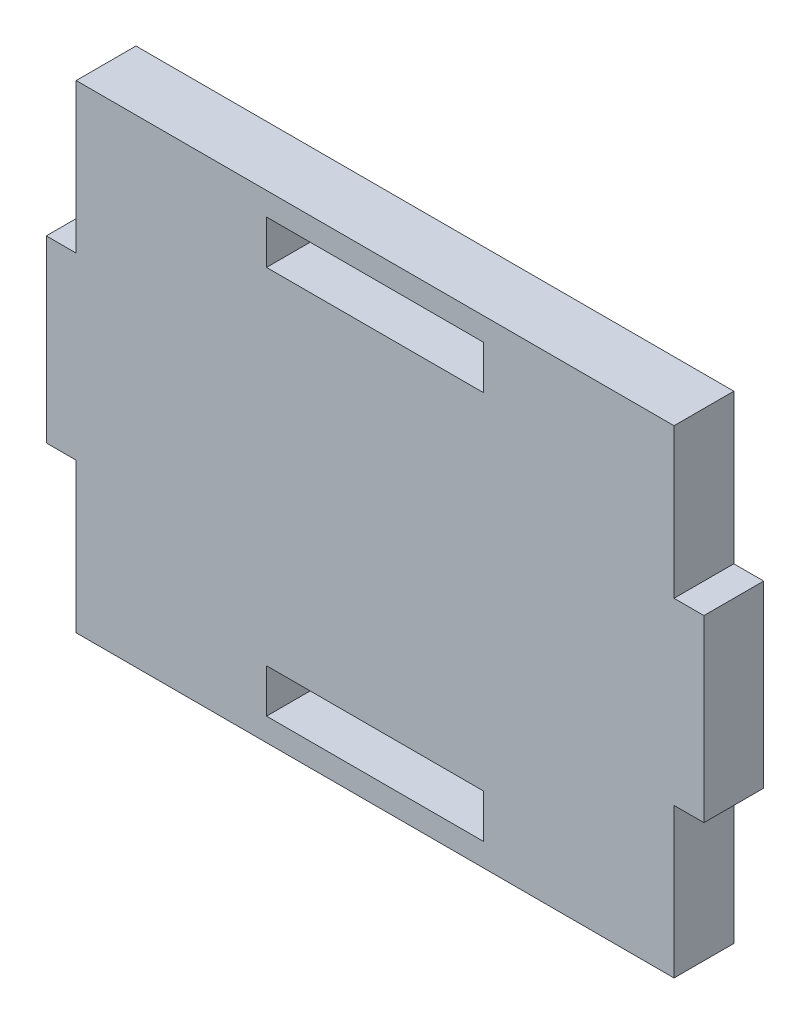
ISO-10303-21;
HEADER;
FILE_DESCRIPTION(('STEP AP214'),'2;1');
FILE_NAME('part.step','',(''),(''),'','','');
FILE_SCHEMA(('AUTOMOTIVE_DESIGN { 1 0 10303 214 1 1 1 1 }'));
ENDSEC;
DATA;
#1=APPLICATION_CONTEXT('core data for automotive mechanical design processes');
#2=APPLICATION_PROTOCOL_DEFINITION('international standard','automotive_design',2000,#1);
#3=PRODUCT_CONTEXT('',#1,'mechanical');
#4=PRODUCT('Part','Part','',(#3));
#5=PRODUCT_RELATED_PRODUCT_CATEGORY('part','',(#4));
#6=PRODUCT_DEFINITION_FORMATION('','',#4);
#7=PRODUCT_DEFINITION_CONTEXT('part definition',#1,'design');
#8=PRODUCT_DEFINITION('design','',#6,#7);
#9=PRODUCT_DEFINITION_SHAPE('','',#8);
#10=(LENGTH_UNIT() NAMED_UNIT(*) SI_UNIT(.MILLI.,.METRE.));
#11=(NAMED_UNIT(*) PLANE_ANGLE_UNIT() SI_UNIT($,.RADIAN.));
#12=(NAMED_UNIT(*) SI_UNIT($,.STERADIAN.) SOLID_ANGLE_UNIT());
#13=UNCERTAINTY_MEASURE_WITH_UNIT(LENGTH_MEASURE(1.E-05),#10,'distance_accuracy_value','');
#14=(GEOMETRIC_REPRESENTATION_CONTEXT(3) GLOBAL_UNCERTAINTY_ASSIGNED_CONTEXT((#13)) GLOBAL_UNIT_ASSIGNED_CONTEXT((#10,
#11,#12)) REPRESENTATION_CONTEXT('',''));
#15=CARTESIAN_POINT('',(0.,0.,0.));
#16=DIRECTION('',(0.,0.,1.));
#17=DIRECTION('',(1.,0.,0.));
#18=AXIS2_PLACEMENT_3D('',#15,#16,#17);
#19=CARTESIAN_POINT('',(0.,0.,10.));
#20=DIRECTION('',(0.,0.,-1.));
#21=DIRECTION('',(-1.,0.,0.));
#22=AXIS2_PLACEMENT_3D('',#19,#20,#21);
#23=PLANE('',#22);
#24=DIRECTION('',(0.,1.,0.));
#25=VECTOR('',#24,1.);
#26=CARTESIAN_POINT('',(18.1593360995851,28.8485477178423,10.));
#27=LINE('',#26,#25);
#28=CARTESIAN_POINT('',(18.1593360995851,28.8485477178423,10.));
#29=VERTEX_POINT('',#28);
#30=CARTESIAN_POINT('',(18.1593360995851,36.1514522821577,10.));
#31=VERTEX_POINT('',#30);
#32=EDGE_CURVE('E206',#29,#31,#27,.T.);
#33=ORIENTED_EDGE('',*,*,#32,.F.);
#34=DIRECTION('',(1.,0.,0.));
#35=VECTOR('',#34,1.);
#36=CARTESIAN_POINT('',(-18.1593360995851,28.8485477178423,10.));
#37=LINE('',#36,#35);
#38=CARTESIAN_POINT('',(-18.1593360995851,28.8485477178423,10.));
#39=VERTEX_POINT('',#38);
#40=EDGE_CURVE('E214',#39,#29,#37,.T.);
#41=ORIENTED_EDGE('',*,*,#40,.F.);
#42=DIRECTION('',(0.,-1.,0.));
#43=VECTOR('',#42,1.);
#44=CARTESIAN_POINT('',(-18.1593360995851,28.8485477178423,10.));
#45=LINE('',#44,#43);
#46=CARTESIAN_POINT('',(-18.1593360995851,36.1514522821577,10.));
#47=VERTEX_POINT('',#46);
#48=EDGE_CURVE('E211',#47,#39,#45,.T.);
#49=ORIENTED_EDGE('',*,*,#48,.F.);
#50=DIRECTION('',(-1.,0.,0.));
#51=VECTOR('',#50,1.);
#52=CARTESIAN_POINT('',(-18.1593360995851,36.1514522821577,10.));
#53=LINE('',#52,#51);
#54=EDGE_CURVE('E208',#31,#47,#53,.T.);
#55=ORIENTED_EDGE('',*,*,#54,.F.);
#56=EDGE_LOOP('',(#33,#41,#49,#55));
#57=FACE_BOUND('',#56,.T.);
#58=DIRECTION('',(0.,1.,0.));
#59=VECTOR('',#58,1.);
#60=CARTESIAN_POINT('',(50.,15.,10.));
#61=LINE('',#60,#59);
#62=CARTESIAN_POINT('',(50.,15.,10.));
#63=VERTEX_POINT('',#62);
#64=CARTESIAN_POINT('',(50.,40.,10.));
#65=VERTEX_POINT('',#64);
#66=EDGE_CURVE('E237',#63,#65,#61,.T.);
#67=ORIENTED_EDGE('',*,*,#66,.T.);
#68=DIRECTION('',(-1.,0.,0.));
#69=VECTOR('',#68,1.);
#70=CARTESIAN_POINT('',(-50.,40.,10.));
#71=LINE('',#70,#69);
#72=CARTESIAN_POINT('',(-50.,40.,10.));
#73=VERTEX_POINT('',#72);
#74=EDGE_CURVE('E240',#65,#73,#71,.T.);
#75=ORIENTED_EDGE('',*,*,#74,.T.);
#76=DIRECTION('',(0.,-1.,0.));
#77=VECTOR('',#76,1.);
#78=CARTESIAN_POINT('',(-50.,15.,10.));
#79=LINE('',#78,#77);
#80=CARTESIAN_POINT('',(-50.,15.,10.));
#81=VERTEX_POINT('',#80);
#82=EDGE_CURVE('E243',#73,#81,#79,.T.);
#83=ORIENTED_EDGE('',*,*,#82,.T.);
#84=DIRECTION('',(-1.,0.,0.));
#85=VECTOR('',#84,1.);
#86=CARTESIAN_POINT('',(-55.,15.,10.));
#87=LINE('',#86,#85);
#88=CARTESIAN_POINT('',(-55.,15.,10.));
#89=VERTEX_POINT('',#88);
#90=EDGE_CURVE('E245',#81,#89,#87,.T.);
#91=ORIENTED_EDGE('',*,*,#90,.T.);
#92=DIRECTION('',(0.,-1.,0.));
#93=VECTOR('',#92,1.);
#94=CARTESIAN_POINT('',(-55.,-15.,10.));
#95=LINE('',#94,#93);
#96=CARTESIAN_POINT('',(-55.,-15.,10.));
#97=VERTEX_POINT('',#96);
#98=EDGE_CURVE('E247',#89,#97,#95,.T.);
#99=ORIENTED_EDGE('',*,*,#98,.T.);
#100=DIRECTION('',(1.,0.,0.));
#101=VECTOR('',#100,1.);
#102=CARTESIAN_POINT('',(-55.,-15.,10.));
#103=LINE('',#102,#101);
#104=CARTESIAN_POINT('',(-50.,-15.,10.));
#105=VERTEX_POINT('',#104);
#106=EDGE_CURVE('E249',#97,#105,#103,.T.);
#107=ORIENTED_EDGE('',*,*,#106,.T.);
#108=DIRECTION('',(0.,-1.,0.));
#109=VECTOR('',#108,1.);
#110=CARTESIAN_POINT('',(-50.,-40.,10.));
#111=LINE('',#110,#109);
#112=CARTESIAN_POINT('',(-50.,-40.,10.));
#113=VERTEX_POINT('',#112);
#114=EDGE_CURVE('E251',#105,#113,#111,.T.);
#115=ORIENTED_EDGE('',*,*,#114,.T.);
#116=DIRECTION('',(1.,0.,0.));
#117=VECTOR('',#116,1.);
#118=CARTESIAN_POINT('',(-50.,-40.,10.));
#119=LINE('',#118,#117);
#120=CARTESIAN_POINT('',(50.,-40.,10.));
#121=VERTEX_POINT('',#120);
#122=EDGE_CURVE('E253',#113,#121,#119,.T.);
#123=ORIENTED_EDGE('',*,*,#122,.T.);
#124=DIRECTION('',(0.,1.,0.));
#125=VECTOR('',#124,1.);
#126=CARTESIAN_POINT('',(50.,-40.,10.));
#127=LINE('',#126,#125);
#128=CARTESIAN_POINT('',(50.,-15.,10.));
#129=VERTEX_POINT('',#128);
#130=EDGE_CURVE('E255',#121,#129,#127,.T.);
#131=ORIENTED_EDGE('',*,*,#130,.T.);
#132=DIRECTION('',(1.,0.,0.));
#133=VECTOR('',#132,1.);
#134=CARTESIAN_POINT('',(55.,-15.,10.));
#135=LINE('',#134,#133);
#136=CARTESIAN_POINT('',(55.,-15.,10.));
#137=VERTEX_POINT('',#136);
#138=EDGE_CURVE('E257',#129,#137,#135,.T.);
#139=ORIENTED_EDGE('',*,*,#138,.T.);
#140=DIRECTION('',(0.,1.,0.));
#141=VECTOR('',#140,1.);
#142=CARTESIAN_POINT('',(55.,-15.,10.));
#143=LINE('',#142,#141);
#144=CARTESIAN_POINT('',(55.,15.,10.));
#145=VERTEX_POINT('',#144);
#146=EDGE_CURVE('E259',#137,#145,#143,.T.);
#147=ORIENTED_EDGE('',*,*,#146,.T.);
#148=DIRECTION('',(-1.,0.,0.));
#149=VECTOR('',#148,1.);
#150=CARTESIAN_POINT('',(55.,15.,10.));
#151=LINE('',#150,#149);
#152=EDGE_CURVE('E261',#145,#63,#151,.T.);
#153=ORIENTED_EDGE('',*,*,#152,.T.);
#154=EDGE_LOOP('',(#67,#75,#83,#91,#99,#107,#115,#123,#131,#139,#147,#153));
#155=FACE_BOUND('',#154,.T.);
#156=DIRECTION('',(-1.,0.,0.));
#157=VECTOR('',#156,1.);
#158=CARTESIAN_POINT('',(-18.1593360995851,-28.8485477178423,10.));
#159=LINE('',#158,#157);
#160=CARTESIAN_POINT('',(18.1593360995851,-28.8485477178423,10.));
#161=VERTEX_POINT('',#160);
#162=CARTESIAN_POINT('',(-18.1593360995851,-28.8485477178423,10.));
#163=VERTEX_POINT('',#162);
#164=EDGE_CURVE('E170',#161,#163,#159,.T.);
#165=ORIENTED_EDGE('',*,*,#164,.F.);
#166=DIRECTION('',(0.,1.,0.));
#167=VECTOR('',#166,1.);
#168=CARTESIAN_POINT('',(18.1593360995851,-28.8485477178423,10.));
#169=LINE('',#168,#167);
#170=CARTESIAN_POINT('',(18.1593360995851,-36.1514522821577,10.));
#171=VERTEX_POINT('',#170);
#172=EDGE_CURVE('E192',#171,#161,#169,.T.);
#173=ORIENTED_EDGE('',*,*,#172,.F.);
#174=DIRECTION('',(1.,0.,0.));
#175=VECTOR('',#174,1.);
#176=CARTESIAN_POINT('',(-18.1593360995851,-36.1514522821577,10.));
#177=LINE('',#176,#175);
#178=CARTESIAN_POINT('',(-18.1593360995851,-36.1514522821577,10.));
#179=VERTEX_POINT('',#178);
#180=EDGE_CURVE('E190',#179,#171,#177,.T.);
#181=ORIENTED_EDGE('',*,*,#180,.F.);
#182=DIRECTION('',(0.,-1.,0.));
#183=VECTOR('',#182,1.);
#184=CARTESIAN_POINT('',(-18.1593360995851,-28.8485477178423,10.));
#185=LINE('',#184,#183);
#186=EDGE_CURVE('E178',#163,#179,#185,.T.);
#187=ORIENTED_EDGE('',*,*,#186,.F.);
#188=EDGE_LOOP('',(#165,#173,#181,#187));
#189=FACE_BOUND('',#188,.T.);
#190=ADVANCED_FACE('F33',(#57,#155,#189),#23,.F.);
#191=CARTESIAN_POINT('',(0.,0.,0.));
#192=DIRECTION('',(0.,0.,-1.));
#193=DIRECTION('',(-1.,0.,0.));
#194=AXIS2_PLACEMENT_3D('',#191,#192,#193);
#195=PLANE('',#194);
#196=DIRECTION('',(0.,1.,0.));
#197=VECTOR('',#196,1.);
#198=CARTESIAN_POINT('',(50.,15.,0.));
#199=LINE('',#198,#197);
#200=CARTESIAN_POINT('',(50.,15.,0.));
#201=VERTEX_POINT('',#200);
#202=CARTESIAN_POINT('',(50.,40.,0.));
#203=VERTEX_POINT('',#202);
#204=EDGE_CURVE('E236',#201,#203,#199,.T.);
#205=ORIENTED_EDGE('',*,*,#204,.F.);
#206=DIRECTION('',(-1.,0.,0.));
#207=VECTOR('',#206,1.);
#208=CARTESIAN_POINT('',(55.,15.,0.));
#209=LINE('',#208,#207);
#210=CARTESIAN_POINT('',(55.,15.,0.));
#211=VERTEX_POINT('',#210);
#212=EDGE_CURVE('E241',#211,#201,#209,.T.);
#213=ORIENTED_EDGE('',*,*,#212,.F.);
#214=DIRECTION('',(0.,1.,0.));
#215=VECTOR('',#214,1.);
#216=CARTESIAN_POINT('',(55.,-15.,0.));
#217=LINE('',#216,#215);
#218=CARTESIAN_POINT('',(55.,-15.,0.));
#219=VERTEX_POINT('',#218);
#220=EDGE_CURVE('E284',#219,#211,#217,.T.);
#221=ORIENTED_EDGE('',*,*,#220,.F.);
#222=DIRECTION('',(1.,0.,0.));
#223=VECTOR('',#222,1.);
#224=CARTESIAN_POINT('',(55.,-15.,0.));
#225=LINE('',#224,#223);
#226=CARTESIAN_POINT('',(50.,-15.,0.));
#227=VERTEX_POINT('',#226);
#228=EDGE_CURVE('E282',#227,#219,#225,.T.);
#229=ORIENTED_EDGE('',*,*,#228,.F.);
#230=DIRECTION('',(0.,1.,0.));
#231=VECTOR('',#230,1.);
#232=CARTESIAN_POINT('',(50.,-40.,0.));
#233=LINE('',#232,#231);
#234=CARTESIAN_POINT('',(50.,-40.,0.));
#235=VERTEX_POINT('',#234);
#236=EDGE_CURVE('E280',#235,#227,#233,.T.);
#237=ORIENTED_EDGE('',*,*,#236,.F.);
#238=DIRECTION('',(1.,0.,0.));
#239=VECTOR('',#238,1.);
#240=CARTESIAN_POINT('',(-50.,-40.,0.));
#241=LINE('',#240,#239);
#242=CARTESIAN_POINT('',(-50.,-40.,0.));
#243=VERTEX_POINT('',#242);
#244=EDGE_CURVE('E278',#243,#235,#241,.T.);
#245=ORIENTED_EDGE('',*,*,#244,.F.);
#246=DIRECTION('',(0.,-1.,0.));
#247=VECTOR('',#246,1.);
#248=CARTESIAN_POINT('',(-50.,-40.,0.));
#249=LINE('',#248,#247);
#250=CARTESIAN_POINT('',(-50.,-15.,0.));
#251=VERTEX_POINT('',#250);
#252=EDGE_CURVE('E276',#251,#243,#249,.T.);
#253=ORIENTED_EDGE('',*,*,#252,.F.);
#254=DIRECTION('',(1.,0.,0.));
#255=VECTOR('',#254,1.);
#256=CARTESIAN_POINT('',(-55.,-15.,0.));
#257=LINE('',#256,#255);
#258=CARTESIAN_POINT('',(-55.,-15.,0.));
#259=VERTEX_POINT('',#258);
#260=EDGE_CURVE('E274',#259,#251,#257,.T.);
#261=ORIENTED_EDGE('',*,*,#260,.F.);
#262=DIRECTION('',(0.,-1.,0.));
#263=VECTOR('',#262,1.);
#264=CARTESIAN_POINT('',(-55.,-15.,0.));
#265=LINE('',#264,#263);
#266=CARTESIAN_POINT('',(-55.,15.,0.));
#267=VERTEX_POINT('',#266);
#268=EDGE_CURVE('E272',#267,#259,#265,.T.);
#269=ORIENTED_EDGE('',*,*,#268,.F.);
#270=DIRECTION('',(-1.,0.,0.));
#271=VECTOR('',#270,1.);
#272=CARTESIAN_POINT('',(-55.,15.,0.));
#273=LINE('',#272,#271);
#274=CARTESIAN_POINT('',(-50.,15.,0.));
#275=VERTEX_POINT('',#274);
#276=EDGE_CURVE('E270',#275,#267,#273,.T.);
#277=ORIENTED_EDGE('',*,*,#276,.F.);
#278=DIRECTION('',(0.,-1.,0.));
#279=VECTOR('',#278,1.);
#280=CARTESIAN_POINT('',(-50.,15.,0.));
#281=LINE('',#280,#279);
#282=CARTESIAN_POINT('',(-50.,40.,0.));
#283=VERTEX_POINT('',#282);
#284=EDGE_CURVE('E268',#283,#275,#281,.T.);
#285=ORIENTED_EDGE('',*,*,#284,.F.);
#286=DIRECTION('',(-1.,0.,0.));
#287=VECTOR('',#286,1.);
#288=CARTESIAN_POINT('',(-50.,40.,0.));
#289=LINE('',#288,#287);
#290=EDGE_CURVE('E266',#203,#283,#289,.T.);
#291=ORIENTED_EDGE('',*,*,#290,.F.);
#292=EDGE_LOOP('',(#205,#213,#221,#229,#237,#245,#253,#261,#269,#277,#285,#291));
#293=FACE_BOUND('',#292,.T.);
#294=DIRECTION('',(1.,0.,0.));
#295=VECTOR('',#294,1.);
#296=CARTESIAN_POINT('',(-18.1593360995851,28.8485477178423,0.));
#297=LINE('',#296,#295);
#298=CARTESIAN_POINT('',(-18.1593360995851,28.8485477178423,0.));
#299=VERTEX_POINT('',#298);
#300=CARTESIAN_POINT('',(18.1593360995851,28.8485477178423,0.));
#301=VERTEX_POINT('',#300);
#302=EDGE_CURVE('E209',#299,#301,#297,.T.);
#303=ORIENTED_EDGE('',*,*,#302,.T.);
#304=DIRECTION('',(0.,1.,0.));
#305=VECTOR('',#304,1.);
#306=CARTESIAN_POINT('',(18.1593360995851,28.8485477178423,0.));
#307=LINE('',#306,#305);
#308=CARTESIAN_POINT('',(18.1593360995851,36.1514522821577,0.));
#309=VERTEX_POINT('',#308);
#310=EDGE_CURVE('E186',#301,#309,#307,.T.);
#311=ORIENTED_EDGE('',*,*,#310,.T.);
#312=DIRECTION('',(-1.,0.,0.));
#313=VECTOR('',#312,1.);
#314=CARTESIAN_POINT('',(-18.1593360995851,36.1514522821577,0.));
#315=LINE('',#314,#313);
#316=CARTESIAN_POINT('',(-18.1593360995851,36.1514522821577,0.));
#317=VERTEX_POINT('',#316);
#318=EDGE_CURVE('E219',#309,#317,#315,.T.);
#319=ORIENTED_EDGE('',*,*,#318,.T.);
#320=DIRECTION('',(0.,-1.,0.));
#321=VECTOR('',#320,1.);
#322=CARTESIAN_POINT('',(-18.1593360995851,28.8485477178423,0.));
#323=LINE('',#322,#321);
#324=EDGE_CURVE('E222',#317,#299,#323,.T.);
#325=ORIENTED_EDGE('',*,*,#324,.T.);
#326=EDGE_LOOP('',(#303,#311,#319,#325));
#327=FACE_BOUND('',#326,.T.);
#328=DIRECTION('',(0.,1.,0.));
#329=VECTOR('',#328,1.);
#330=CARTESIAN_POINT('',(18.1593360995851,-28.8485477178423,0.));
#331=LINE('',#330,#329);
#332=CARTESIAN_POINT('',(18.1593360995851,-36.1514522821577,0.));
#333=VERTEX_POINT('',#332);
#334=CARTESIAN_POINT('',(18.1593360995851,-28.8485477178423,0.));
#335=VERTEX_POINT('',#334);
#336=EDGE_CURVE('E179',#333,#335,#331,.T.);
#337=ORIENTED_EDGE('',*,*,#336,.T.);
#338=DIRECTION('',(-1.,0.,0.));
#339=VECTOR('',#338,1.);
#340=CARTESIAN_POINT('',(-18.1593360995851,-28.8485477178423,0.));
#341=LINE('',#340,#339);
#342=CARTESIAN_POINT('',(-18.1593360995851,-28.8485477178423,0.));
#343=VERTEX_POINT('',#342);
#344=EDGE_CURVE('E56',#335,#343,#341,.T.);
#345=ORIENTED_EDGE('',*,*,#344,.T.);
#346=DIRECTION('',(0.,-1.,0.));
#347=VECTOR('',#346,1.);
#348=CARTESIAN_POINT('',(-18.1593360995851,-28.8485477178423,0.));
#349=LINE('',#348,#347);
#350=CARTESIAN_POINT('',(-18.1593360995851,-36.1514522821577,0.));
#351=VERTEX_POINT('',#350);
#352=EDGE_CURVE('E185',#343,#351,#349,.T.);
#353=ORIENTED_EDGE('',*,*,#352,.T.);
#354=DIRECTION('',(1.,0.,0.));
#355=VECTOR('',#354,1.);
#356=CARTESIAN_POINT('',(-18.1593360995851,-36.1514522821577,0.));
#357=LINE('',#356,#355);
#358=EDGE_CURVE('E198',#351,#333,#357,.T.);
#359=ORIENTED_EDGE('',*,*,#358,.T.);
#360=EDGE_LOOP('',(#337,#345,#353,#359));
#361=FACE_BOUND('',#360,.T.);
#362=ADVANCED_FACE('F326',(#293,#327,#361),#195,.T.);
#363=CARTESIAN_POINT('',(50.,15.,10.));
#364=DIRECTION('',(-1.,0.,0.));
#365=DIRECTION('',(0.,-1.,0.));
#366=AXIS2_PLACEMENT_3D('',#363,#364,#365);
#367=PLANE('',#366);
#368=ORIENTED_EDGE('',*,*,#204,.T.);
#369=DIRECTION('',(0.,0.,-1.));
#370=VECTOR('',#369,1.);
#371=CARTESIAN_POINT('',(50.,40.,10.));
#372=LINE('',#371,#370);
#373=EDGE_CURVE('E11',#65,#203,#372,.T.);
#374=ORIENTED_EDGE('',*,*,#373,.F.);
#375=ORIENTED_EDGE('',*,*,#66,.F.);
#376=DIRECTION('',(0.,0.,-1.));
#377=VECTOR('',#376,1.);
#378=CARTESIAN_POINT('',(50.,15.,10.));
#379=LINE('',#378,#377);
#380=EDGE_CURVE('E263',#63,#201,#379,.T.);
#381=ORIENTED_EDGE('',*,*,#380,.T.);
#382=EDGE_LOOP('',(#368,#374,#375,#381));
#383=FACE_BOUND('',#382,.T.);
#384=ADVANCED_FACE('F35',(#383),#367,.F.);
#385=CARTESIAN_POINT('',(-50.,40.,10.));
#386=DIRECTION('',(0.,-1.,0.));
#387=DIRECTION('',(1.,0.,0.));
#388=AXIS2_PLACEMENT_3D('',#385,#386,#387);
#389=PLANE('',#388);
#390=ORIENTED_EDGE('',*,*,#290,.T.);
#391=DIRECTION('',(0.,0.,-1.));
#392=VECTOR('',#391,1.);
#393=CARTESIAN_POINT('',(-50.,40.,10.));
#394=LINE('',#393,#392);
#395=EDGE_CURVE('E41',#73,#283,#394,.T.);
#396=ORIENTED_EDGE('',*,*,#395,.F.);
#397=ORIENTED_EDGE('',*,*,#74,.F.);
#398=ORIENTED_EDGE('',*,*,#373,.T.);
#399=EDGE_LOOP('',(#390,#396,#397,#398));
#400=FACE_BOUND('',#399,.T.);
#401=ADVANCED_FACE('F343',(#400),#389,.F.);
#402=CARTESIAN_POINT('',(-50.,15.,10.));
#403=DIRECTION('',(1.,0.,0.));
#404=DIRECTION('',(0.,0.,-1.));
#405=AXIS2_PLACEMENT_3D('',#402,#403,#404);
#406=PLANE('',#405);
#407=ORIENTED_EDGE('',*,*,#284,.T.);
#408=DIRECTION('',(0.,0.,-1.));
#409=VECTOR('',#408,1.);
#410=CARTESIAN_POINT('',(-50.,15.,10.));
#411=LINE('',#410,#409);
#412=EDGE_CURVE('E313',#81,#275,#411,.T.);
#413=ORIENTED_EDGE('',*,*,#412,.F.);
#414=ORIENTED_EDGE('',*,*,#82,.F.);
#415=ORIENTED_EDGE('',*,*,#395,.T.);
#416=EDGE_LOOP('',(#407,#413,#414,#415));
#417=FACE_BOUND('',#416,.T.);
#418=ADVANCED_FACE('F320',(#417),#406,.F.);
#419=CARTESIAN_POINT('',(-55.,15.,10.));
#420=DIRECTION('',(0.,-1.,0.));
#421=DIRECTION('',(0.,0.,-1.));
#422=AXIS2_PLACEMENT_3D('',#419,#420,#421);
#423=PLANE('',#422);
#424=ORIENTED_EDGE('',*,*,#276,.T.);
#425=DIRECTION('',(0.,0.,-1.));
#426=VECTOR('',#425,1.);
#427=CARTESIAN_POINT('',(-55.,15.,10.));
#428=LINE('',#427,#426);
#429=EDGE_CURVE('E310',#89,#267,#428,.T.);
#430=ORIENTED_EDGE('',*,*,#429,.F.);
#431=ORIENTED_EDGE('',*,*,#90,.F.);
#432=ORIENTED_EDGE('',*,*,#412,.T.);
#433=EDGE_LOOP('',(#424,#430,#431,#432));
#434=FACE_BOUND('',#433,.T.);
#435=ADVANCED_FACE('F332',(#434),#423,.F.);
#436=CARTESIAN_POINT('',(-55.,-15.,10.));
#437=DIRECTION('',(1.,0.,0.));
#438=DIRECTION('',(0.,0.,-1.));
#439=AXIS2_PLACEMENT_3D('',#436,#437,#438);
#440=PLANE('',#439);
#441=ORIENTED_EDGE('',*,*,#268,.T.);
#442=DIRECTION('',(0.,0.,-1.));
#443=VECTOR('',#442,1.);
#444=CARTESIAN_POINT('',(-55.,-15.,10.));
#445=LINE('',#444,#443);
#446=EDGE_CURVE('E307',#97,#259,#445,.T.);
#447=ORIENTED_EDGE('',*,*,#446,.F.);
#448=ORIENTED_EDGE('',*,*,#98,.F.);
#449=ORIENTED_EDGE('',*,*,#429,.T.);
#450=EDGE_LOOP('',(#441,#447,#448,#449));
#451=FACE_BOUND('',#450,.T.);
#452=ADVANCED_FACE('F336',(#451),#440,.F.);
#453=CARTESIAN_POINT('',(-55.,-15.,10.));
#454=DIRECTION('',(0.,1.,0.));
#455=DIRECTION('',(0.,0.,1.));
#456=AXIS2_PLACEMENT_3D('',#453,#454,#455);
#457=PLANE('',#456);
#458=ORIENTED_EDGE('',*,*,#260,.T.);
#459=DIRECTION('',(0.,0.,-1.));
#460=VECTOR('',#459,1.);
#461=CARTESIAN_POINT('',(-50.,-15.,10.));
#462=LINE('',#461,#460);
#463=EDGE_CURVE('E304',#105,#251,#462,.T.);
#464=ORIENTED_EDGE('',*,*,#463,.F.);
#465=ORIENTED_EDGE('',*,*,#106,.F.);
#466=ORIENTED_EDGE('',*,*,#446,.T.);
#467=EDGE_LOOP('',(#458,#464,#465,#466));
#468=FACE_BOUND('',#467,.T.);
#469=ADVANCED_FACE('F376',(#468),#457,.F.);
#470=CARTESIAN_POINT('',(-50.,-40.,10.));
#471=DIRECTION('',(1.,0.,0.));
#472=DIRECTION('',(0.,1.,0.));
#473=AXIS2_PLACEMENT_3D('',#470,#471,#472);
#474=PLANE('',#473);
#475=ORIENTED_EDGE('',*,*,#252,.T.);
#476=DIRECTION('',(0.,0.,-1.));
#477=VECTOR('',#476,1.);
#478=CARTESIAN_POINT('',(-50.,-40.,10.));
#479=LINE('',#478,#477);
#480=EDGE_CURVE('E301',#113,#243,#479,.T.);
#481=ORIENTED_EDGE('',*,*,#480,.F.);
#482=ORIENTED_EDGE('',*,*,#114,.F.);
#483=ORIENTED_EDGE('',*,*,#463,.T.);
#484=EDGE_LOOP('',(#475,#481,#482,#483));
#485=FACE_BOUND('',#484,.T.);
#486=ADVANCED_FACE('F374',(#485),#474,.F.);
#487=CARTESIAN_POINT('',(-50.,-40.,10.));
#488=DIRECTION('',(0.,1.,0.));
#489=DIRECTION('',(-1.,0.,0.));
#490=AXIS2_PLACEMENT_3D('',#487,#488,#489);
#491=PLANE('',#490);
#492=ORIENTED_EDGE('',*,*,#244,.T.);
#493=DIRECTION('',(0.,0.,-1.));
#494=VECTOR('',#493,1.);
#495=CARTESIAN_POINT('',(50.,-40.,10.));
#496=LINE('',#495,#494);
#497=EDGE_CURVE('E298',#121,#235,#496,.T.);
#498=ORIENTED_EDGE('',*,*,#497,.F.);
#499=ORIENTED_EDGE('',*,*,#122,.F.);
#500=ORIENTED_EDGE('',*,*,#480,.T.);
#501=EDGE_LOOP('',(#492,#498,#499,#500));
#502=FACE_BOUND('',#501,.T.);
#503=ADVANCED_FACE('F370',(#502),#491,.F.);
#504=CARTESIAN_POINT('',(50.,-40.,10.));
#505=DIRECTION('',(-1.,0.,0.));
#506=DIRECTION('',(0.,0.,1.));
#507=AXIS2_PLACEMENT_3D('',#504,#505,#506);
#508=PLANE('',#507);
#509=ORIENTED_EDGE('',*,*,#236,.T.);
#510=DIRECTION('',(0.,0.,-1.));
#511=VECTOR('',#510,1.);
#512=CARTESIAN_POINT('',(50.,-15.,10.));
#513=LINE('',#512,#511);
#514=EDGE_CURVE('E295',#129,#227,#513,.T.);
#515=ORIENTED_EDGE('',*,*,#514,.F.);
#516=ORIENTED_EDGE('',*,*,#130,.F.);
#517=ORIENTED_EDGE('',*,*,#497,.T.);
#518=EDGE_LOOP('',(#509,#515,#516,#517));
#519=FACE_BOUND('',#518,.T.);
#520=ADVANCED_FACE('F365',(#519),#508,.F.);
#521=CARTESIAN_POINT('',(55.,-15.,10.));
#522=DIRECTION('',(0.,1.,0.));
#523=DIRECTION('',(-1.,0.,0.));
#524=AXIS2_PLACEMENT_3D('',#521,#522,#523);
#525=PLANE('',#524);
#526=ORIENTED_EDGE('',*,*,#228,.T.);
#527=DIRECTION('',(0.,0.,-1.));
#528=VECTOR('',#527,1.);
#529=CARTESIAN_POINT('',(55.,-15.,10.));
#530=LINE('',#529,#528);
#531=EDGE_CURVE('E292',#137,#219,#530,.T.);
#532=ORIENTED_EDGE('',*,*,#531,.F.);
#533=ORIENTED_EDGE('',*,*,#138,.F.);
#534=ORIENTED_EDGE('',*,*,#514,.T.);
#535=EDGE_LOOP('',(#526,#532,#533,#534));
#536=FACE_BOUND('',#535,.T.);
#537=ADVANCED_FACE('F359',(#536),#525,.F.);
#538=CARTESIAN_POINT('',(55.,-15.,10.));
#539=DIRECTION('',(-1.,0.,0.));
#540=DIRECTION('',(0.,0.,1.));
#541=AXIS2_PLACEMENT_3D('',#538,#539,#540);
#542=PLANE('',#541);
#543=ORIENTED_EDGE('',*,*,#220,.T.);
#544=DIRECTION('',(0.,0.,-1.));
#545=VECTOR('',#544,1.);
#546=CARTESIAN_POINT('',(55.,15.,10.));
#547=LINE('',#546,#545);
#548=EDGE_CURVE('E289',#145,#211,#547,.T.);
#549=ORIENTED_EDGE('',*,*,#548,.F.);
#550=ORIENTED_EDGE('',*,*,#146,.F.);
#551=ORIENTED_EDGE('',*,*,#531,.T.);
#552=EDGE_LOOP('',(#543,#549,#550,#551));
#553=FACE_BOUND('',#552,.T.);
#554=ADVANCED_FACE('F355',(#553),#542,.F.);
#555=CARTESIAN_POINT('',(55.,15.,10.));
#556=DIRECTION('',(0.,-1.,0.));
#557=DIRECTION('',(1.,0.,0.));
#558=AXIS2_PLACEMENT_3D('',#555,#556,#557);
#559=PLANE('',#558);
#560=ORIENTED_EDGE('',*,*,#212,.T.);
#561=ORIENTED_EDGE('',*,*,#380,.F.);
#562=ORIENTED_EDGE('',*,*,#152,.F.);
#563=ORIENTED_EDGE('',*,*,#548,.T.);
#564=EDGE_LOOP('',(#560,#561,#562,#563));
#565=FACE_BOUND('',#564,.T.);
#566=ADVANCED_FACE('F350',(#565),#559,.F.);
#567=CARTESIAN_POINT('',(18.1593360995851,28.8485477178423,10.));
#568=DIRECTION('',(-1.,0.,0.));
#569=DIRECTION('',(0.,0.,1.));
#570=AXIS2_PLACEMENT_3D('',#567,#568,#569);
#571=PLANE('',#570);
#572=ORIENTED_EDGE('',*,*,#310,.F.);
#573=DIRECTION('',(0.,0.,-1.));
#574=VECTOR('',#573,1.);
#575=CARTESIAN_POINT('',(18.1593360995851,28.8485477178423,10.));
#576=LINE('',#575,#574);
#577=EDGE_CURVE('E216',#29,#301,#576,.T.);
#578=ORIENTED_EDGE('',*,*,#577,.F.);
#579=ORIENTED_EDGE('',*,*,#32,.T.);
#580=DIRECTION('',(0.,0.,-1.));
#581=VECTOR('',#580,1.);
#582=CARTESIAN_POINT('',(18.1593360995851,36.1514522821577,10.));
#583=LINE('',#582,#581);
#584=EDGE_CURVE('E233',#31,#309,#583,.T.);
#585=ORIENTED_EDGE('',*,*,#584,.T.);
#586=EDGE_LOOP('',(#572,#578,#579,#585));
#587=FACE_BOUND('',#586,.T.);
#588=ADVANCED_FACE('F394',(#587),#571,.T.);
#589=CARTESIAN_POINT('',(-18.1593360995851,36.1514522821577,10.));
#590=DIRECTION('',(0.,-1.,0.));
#591=DIRECTION('',(0.,0.,-1.));
#592=AXIS2_PLACEMENT_3D('',#589,#590,#591);
#593=PLANE('',#592);
#594=ORIENTED_EDGE('',*,*,#318,.F.);
#595=ORIENTED_EDGE('',*,*,#584,.F.);
#596=ORIENTED_EDGE('',*,*,#54,.T.);
#597=DIRECTION('',(0.,0.,-1.));
#598=VECTOR('',#597,1.);
#599=CARTESIAN_POINT('',(-18.1593360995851,36.1514522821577,10.));
#600=LINE('',#599,#598);
#601=EDGE_CURVE('E231',#47,#317,#600,.T.);
#602=ORIENTED_EDGE('',*,*,#601,.T.);
#603=EDGE_LOOP('',(#594,#595,#596,#602));
#604=FACE_BOUND('',#603,.T.);
#605=ADVANCED_FACE('F432',(#604),#593,.T.);
#606=CARTESIAN_POINT('',(-18.1593360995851,28.8485477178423,10.));
#607=DIRECTION('',(1.,0.,0.));
#608=DIRECTION('',(0.,0.,-1.));
#609=AXIS2_PLACEMENT_3D('',#606,#607,#608);
#610=PLANE('',#609);
#611=ORIENTED_EDGE('',*,*,#324,.F.);
#612=ORIENTED_EDGE('',*,*,#601,.F.);
#613=ORIENTED_EDGE('',*,*,#48,.T.);
#614=DIRECTION('',(0.,0.,-1.));
#615=VECTOR('',#614,1.);
#616=CARTESIAN_POINT('',(-18.1593360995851,28.8485477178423,10.));
#617=LINE('',#616,#615);
#618=EDGE_CURVE('E229',#39,#299,#617,.T.);
#619=ORIENTED_EDGE('',*,*,#618,.T.);
#620=EDGE_LOOP('',(#611,#612,#613,#619));
#621=FACE_BOUND('',#620,.T.);
#622=ADVANCED_FACE('F439',(#621),#610,.T.);
#623=CARTESIAN_POINT('',(-18.1593360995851,28.8485477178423,10.));
#624=DIRECTION('',(0.,1.,0.));
#625=DIRECTION('',(-1.,0.,0.));
#626=AXIS2_PLACEMENT_3D('',#623,#624,#625);
#627=PLANE('',#626);
#628=ORIENTED_EDGE('',*,*,#302,.F.);
#629=ORIENTED_EDGE('',*,*,#618,.F.);
#630=ORIENTED_EDGE('',*,*,#40,.T.);
#631=ORIENTED_EDGE('',*,*,#577,.T.);
#632=EDGE_LOOP('',(#628,#629,#630,#631));
#633=FACE_BOUND('',#632,.T.);
#634=ADVANCED_FACE('F446',(#633),#627,.T.);
#635=CARTESIAN_POINT('',(-18.1593360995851,-28.8485477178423,10.));
#636=DIRECTION('',(0.,-1.,0.));
#637=DIRECTION('',(1.,0.,0.));
#638=AXIS2_PLACEMENT_3D('',#635,#636,#637);
#639=PLANE('',#638);
#640=ORIENTED_EDGE('',*,*,#344,.F.);
#641=DIRECTION('',(0.,0.,-1.));
#642=VECTOR('',#641,1.);
#643=CARTESIAN_POINT('',(18.1593360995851,-28.8485477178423,10.));
#644=LINE('',#643,#642);
#645=EDGE_CURVE('E174',#161,#335,#644,.T.);
#646=ORIENTED_EDGE('',*,*,#645,.F.);
#647=ORIENTED_EDGE('',*,*,#164,.T.);
#648=DIRECTION('',(0.,0.,-1.));
#649=VECTOR('',#648,1.);
#650=CARTESIAN_POINT('',(-18.1593360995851,-28.8485477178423,10.));
#651=LINE('',#650,#649);
#652=EDGE_CURVE('E173',#163,#343,#651,.T.);
#653=ORIENTED_EDGE('',*,*,#652,.T.);
#654=EDGE_LOOP('',(#640,#646,#647,#653));
#655=FACE_BOUND('',#654,.T.);
#656=ADVANCED_FACE('F172',(#655),#639,.T.);
#657=CARTESIAN_POINT('',(-18.1593360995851,-28.8485477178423,10.));
#658=DIRECTION('',(1.,0.,0.));
#659=DIRECTION('',(0.,0.,-1.));
#660=AXIS2_PLACEMENT_3D('',#657,#658,#659);
#661=PLANE('',#660);
#662=ORIENTED_EDGE('',*,*,#352,.F.);
#663=ORIENTED_EDGE('',*,*,#652,.F.);
#664=ORIENTED_EDGE('',*,*,#186,.T.);
#665=DIRECTION('',(0.,0.,-1.));
#666=VECTOR('',#665,1.);
#667=CARTESIAN_POINT('',(-18.1593360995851,-36.1514522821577,10.));
#668=LINE('',#667,#666);
#669=EDGE_CURVE('E187',#179,#351,#668,.T.);
#670=ORIENTED_EDGE('',*,*,#669,.T.);
#671=EDGE_LOOP('',(#662,#663,#664,#670));
#672=FACE_BOUND('',#671,.T.);
#673=ADVANCED_FACE('F182',(#672),#661,.T.);
#674=CARTESIAN_POINT('',(-18.1593360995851,-36.1514522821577,10.));
#675=DIRECTION('',(0.,1.,0.));
#676=DIRECTION('',(0.,0.,1.));
#677=AXIS2_PLACEMENT_3D('',#674,#675,#676);
#678=PLANE('',#677);
#679=ORIENTED_EDGE('',*,*,#358,.F.);
#680=ORIENTED_EDGE('',*,*,#669,.F.);
#681=ORIENTED_EDGE('',*,*,#180,.T.);
#682=DIRECTION('',(0.,0.,-1.));
#683=VECTOR('',#682,1.);
#684=CARTESIAN_POINT('',(18.1593360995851,-36.1514522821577,10.));
#685=LINE('',#684,#683);
#686=EDGE_CURVE('E48',#171,#333,#685,.T.);
#687=ORIENTED_EDGE('',*,*,#686,.T.);
#688=EDGE_LOOP('',(#679,#680,#681,#687));
#689=FACE_BOUND('',#688,.T.);
#690=ADVANCED_FACE('F467',(#689),#678,.T.);
#691=CARTESIAN_POINT('',(18.1593360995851,-28.8485477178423,10.));
#692=DIRECTION('',(-1.,0.,0.));
#693=DIRECTION('',(0.,0.,1.));
#694=AXIS2_PLACEMENT_3D('',#691,#692,#693);
#695=PLANE('',#694);
#696=ORIENTED_EDGE('',*,*,#336,.F.);
#697=ORIENTED_EDGE('',*,*,#686,.F.);
#698=ORIENTED_EDGE('',*,*,#172,.T.);
#699=ORIENTED_EDGE('',*,*,#645,.T.);
#700=EDGE_LOOP('',(#696,#697,#698,#699));
#701=FACE_BOUND('',#700,.T.);
#702=ADVANCED_FACE('F474',(#701),#695,.T.);
#703=CLOSED_SHELL('',(#190,#362,#384,#401,#418,#435,#452,#469,#486,#503,#520,#537,#554,#566,
#588,#605,#622,#634,#656,#673,#690,#702));
#704=MANIFOLD_SOLID_BREP('B2',#703);
#705=ADVANCED_BREP_SHAPE_REPRESENTATION('',(#18,#704),#14);
#706=SHAPE_DEFINITION_REPRESENTATION(#9,#705);
ENDSEC;
END-ISO-10303-21;
